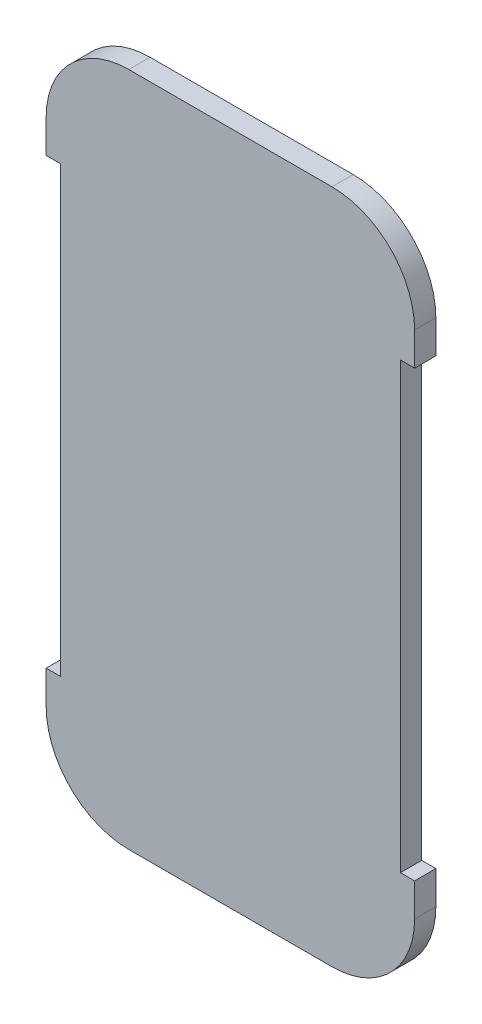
from build123d import *

# Parameters (mm, degrees)
EXTRUDE1_DEPTH = 0.9


with BuildPart() as part:
    # Sketch1 → Extrude1 (new body)
    with BuildSketch(Plane(origin=(0, 0, 4.2), x_dir=(-1, 0, 0), z_dir=(0, 0, -1))):
        with BuildLine():
            Line((-55.7, 309.3), (-64.3, 309.3))
            ThreePointArc((-64.3, 309.3), (-66.774873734, 308.274873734), (-67.8, 305.8))
            Line((-67.8, 305.8), (-67.8, 304.4))
            Line((-67.8, 304.4), (-67.2, 304.4))
            Line((-67.2, 304.4), (-67.2, 285.6))
            Line((-67.2, 285.6), (-67.8, 285.6))
            Line((-67.8, 285.6), (-67.8, 284.2))
            ThreePointArc((-67.8, 284.2), (-66.774873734, 281.725126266), (-64.3, 280.7))
            Line((-64.3, 280.7), (-55.7, 280.7))
            ThreePointArc((-55.7, 280.7), (-53.225126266, 281.725126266), (-52.2, 284.2))
            Line((-52.2, 284.2), (-52.2, 285.6))
            Line((-52.2, 285.6), (-52.8, 285.6))
            Line((-52.8, 285.6), (-52.8, 304.4))
            Line((-52.8, 304.4), (-52.2, 304.4))
            Line((-52.2, 304.4), (-52.2, 305.8))
            ThreePointArc((-52.2, 305.8), (-53.225126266, 308.274873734), (-55.7, 309.3))
        make_face()
    extrude(amount=-EXTRUDE1_DEPTH)


solid = part.part
